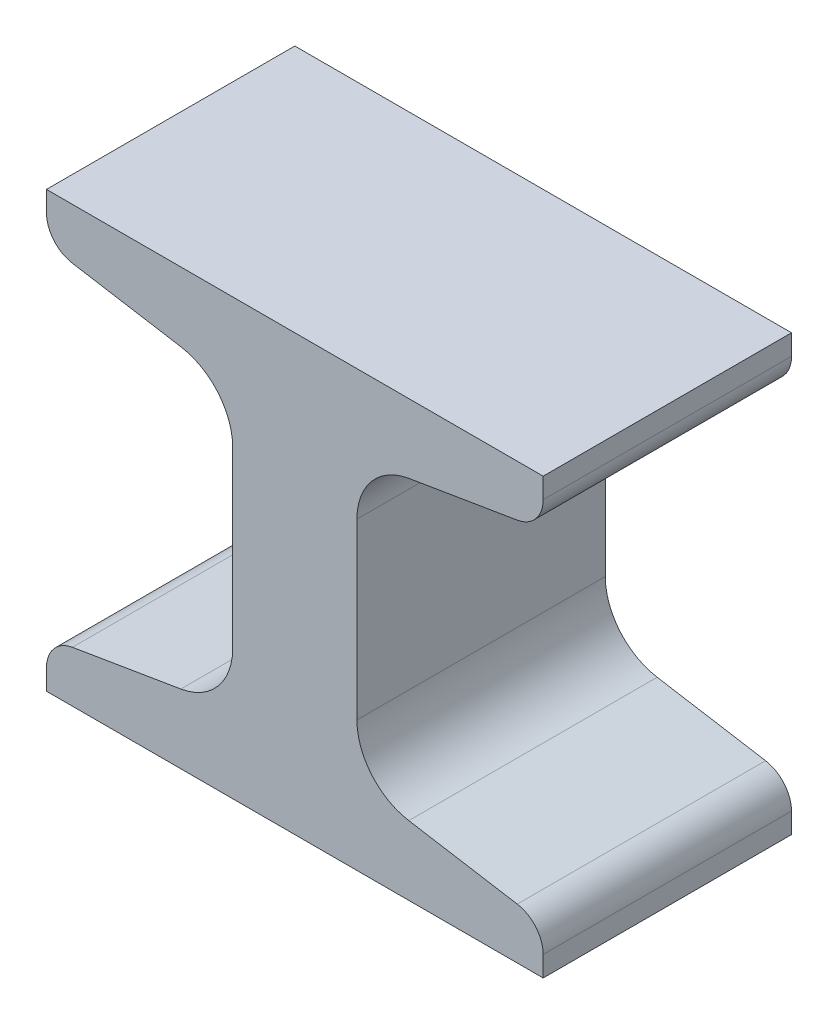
ISO-10303-21;
HEADER;
FILE_DESCRIPTION(('STEP AP214'),'2;1');
FILE_NAME('part.step','',(''),(''),'','','');
FILE_SCHEMA(('AUTOMOTIVE_DESIGN { 1 0 10303 214 1 1 1 1 }'));
ENDSEC;
DATA;
#1=APPLICATION_CONTEXT('core data for automotive mechanical design processes');
#2=APPLICATION_PROTOCOL_DEFINITION('international standard','automotive_design',2000,#1);
#3=PRODUCT_CONTEXT('',#1,'mechanical');
#4=PRODUCT('Part','Part','',(#3));
#5=PRODUCT_RELATED_PRODUCT_CATEGORY('part','',(#4));
#6=PRODUCT_DEFINITION_FORMATION('','',#4);
#7=PRODUCT_DEFINITION_CONTEXT('part definition',#1,'design');
#8=PRODUCT_DEFINITION('design','',#6,#7);
#9=PRODUCT_DEFINITION_SHAPE('','',#8);
#10=(LENGTH_UNIT() NAMED_UNIT(*) SI_UNIT(.MILLI.,.METRE.));
#11=(NAMED_UNIT(*) PLANE_ANGLE_UNIT() SI_UNIT($,.RADIAN.));
#12=(NAMED_UNIT(*) SI_UNIT($,.STERADIAN.) SOLID_ANGLE_UNIT());
#13=UNCERTAINTY_MEASURE_WITH_UNIT(LENGTH_MEASURE(1.E-05),#10,'distance_accuracy_value','');
#14=(GEOMETRIC_REPRESENTATION_CONTEXT(3) GLOBAL_UNCERTAINTY_ASSIGNED_CONTEXT((#13)) GLOBAL_UNIT_ASSIGNED_CONTEXT((#10,
#11,#12)) REPRESENTATION_CONTEXT('',''));
#15=CARTESIAN_POINT('',(0.,0.,0.));
#16=DIRECTION('',(0.,0.,1.));
#17=DIRECTION('',(1.,0.,0.));
#18=AXIS2_PLACEMENT_3D('',#15,#16,#17);
#19=CARTESIAN_POINT('',(50.8,-4.57140674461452E-13,12.7));
#20=DIRECTION('',(0.,-1.,0.));
#21=DIRECTION('',(1.,0.,0.));
#22=AXIS2_PLACEMENT_3D('',#19,#20,#21);
#23=PLANE('',#22);
#24=DIRECTION('',(-1.,0.,0.));
#25=VECTOR('',#24,1.);
#26=CARTESIAN_POINT('',(50.8,-4.57140674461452E-13,-12.7));
#27=LINE('',#26,#25);
#28=CARTESIAN_POINT('',(50.8,-4.57140674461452E-13,-12.7));
#29=VERTEX_POINT('',#28);
#30=CARTESIAN_POINT('',(0.,0.,-12.7));
#31=VERTEX_POINT('',#30);
#32=EDGE_CURVE('E234',#29,#31,#27,.T.);
#33=ORIENTED_EDGE('',*,*,#32,.F.);
#34=DIRECTION('',(0.,0.,-1.));
#35=VECTOR('',#34,1.);
#36=CARTESIAN_POINT('',(50.8,-4.57140674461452E-13,12.7));
#37=LINE('',#36,#35);
#38=CARTESIAN_POINT('',(50.8,-4.57140674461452E-13,12.7));
#39=VERTEX_POINT('',#38);
#40=EDGE_CURVE('E192',#39,#29,#37,.T.);
#41=ORIENTED_EDGE('',*,*,#40,.F.);
#42=DIRECTION('',(-1.,0.,0.));
#43=VECTOR('',#42,1.);
#44=CARTESIAN_POINT('',(50.8,-4.57140674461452E-13,12.7));
#45=LINE('',#44,#43);
#46=CARTESIAN_POINT('',(0.,0.,12.7));
#47=VERTEX_POINT('',#46);
#48=EDGE_CURVE('E187',#39,#47,#45,.T.);
#49=ORIENTED_EDGE('',*,*,#48,.T.);
#50=DIRECTION('',(0.,0.,-1.));
#51=VECTOR('',#50,1.);
#52=CARTESIAN_POINT('',(0.,0.,12.7));
#53=LINE('',#52,#51);
#54=EDGE_CURVE('E170',#47,#31,#53,.T.);
#55=ORIENTED_EDGE('',*,*,#54,.T.);
#56=EDGE_LOOP('',(#33,#41,#49,#55));
#57=FACE_BOUND('',#56,.T.);
#58=ADVANCED_FACE('F33',(#57),#23,.T.);
#59=CARTESIAN_POINT('',(50.8,4.77673693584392,12.7));
#60=DIRECTION('',(1.,0.,0.));
#61=DIRECTION('',(0.,0.,-1.));
#62=AXIS2_PLACEMENT_3D('',#59,#60,#61);
#63=PLANE('',#62);
#64=DIRECTION('',(0.,-1.,0.));
#65=VECTOR('',#64,1.);
#66=CARTESIAN_POINT('',(50.8,4.77673693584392,-12.7));
#67=LINE('',#66,#65);
#68=CARTESIAN_POINT('',(50.8,2.0871406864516,-12.7));
#69=VERTEX_POINT('',#68);
#70=EDGE_CURVE('E193',#69,#29,#67,.T.);
#71=ORIENTED_EDGE('',*,*,#70,.F.);
#72=DIRECTION('',(0.,0.,-1.));
#73=VECTOR('',#72,1.);
#74=CARTESIAN_POINT('',(50.8,2.0871406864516,12.7));
#75=LINE('',#74,#73);
#76=CARTESIAN_POINT('',(50.8,2.0871406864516,12.7));
#77=VERTEX_POINT('',#76);
#78=EDGE_CURVE('E306',#69,#77,#75,.F.);
#79=ORIENTED_EDGE('',*,*,#78,.T.);
#80=DIRECTION('',(0.,-1.,0.));
#81=VECTOR('',#80,1.);
#82=CARTESIAN_POINT('',(50.8,4.77673693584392,12.7));
#83=LINE('',#82,#81);
#84=EDGE_CURVE('E182',#77,#39,#83,.T.);
#85=ORIENTED_EDGE('',*,*,#84,.T.);
#86=ORIENTED_EDGE('',*,*,#40,.T.);
#87=EDGE_LOOP('',(#71,#79,#85,#86));
#88=FACE_BOUND('',#87,.T.);
#89=ADVANCED_FACE('F383',(#88),#63,.T.);
#90=CARTESIAN_POINT('',(37.0559923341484,7.06757198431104,12.7));
#91=DIRECTION('',(0.164410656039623,0.986391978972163,0.));
#92=DIRECTION('',(-0.986391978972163,0.164410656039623,0.));
#93=AXIS2_PLACEMENT_3D('',#90,#91,#92);
#94=PLANE('',#93);
#95=DIRECTION('',(0.986391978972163,-0.164410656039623,0.));
#96=VECTOR('',#95,1.);
#97=CARTESIAN_POINT('',(37.0559923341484,7.06757198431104,12.7));
#98=LINE('',#97,#96);
#99=CARTESIAN_POINT('',(37.0559923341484,7.06757198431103,12.7));
#100=VERTEX_POINT('',#99);
#101=CARTESIAN_POINT('',(48.1470038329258,5.21893521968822,12.7));
#102=VERTEX_POINT('',#101);
#103=EDGE_CURVE('E230',#100,#102,#98,.T.);
#104=ORIENTED_EDGE('',*,*,#103,.T.);
#105=DIRECTION('',(0.,0.,-1.));
#106=VECTOR('',#105,1.);
#107=CARTESIAN_POINT('',(48.1470038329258,5.21893521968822,12.7));
#108=LINE('',#107,#106);
#109=CARTESIAN_POINT('',(48.1470038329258,5.21893521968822,-12.7));
#110=VERTEX_POINT('',#109);
#111=EDGE_CURVE('E273',#102,#110,#108,.T.);
#112=ORIENTED_EDGE('',*,*,#111,.T.);
#113=DIRECTION('',(0.986391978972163,-0.164410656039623,0.));
#114=VECTOR('',#113,1.);
#115=CARTESIAN_POINT('',(37.0559923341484,7.06757198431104,-12.7));
#116=LINE('',#115,#114);
#117=CARTESIAN_POINT('',(37.0559923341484,7.06757198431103,-12.7));
#118=VERTEX_POINT('',#117);
#119=EDGE_CURVE('E195',#118,#110,#116,.T.);
#120=ORIENTED_EDGE('',*,*,#119,.F.);
#121=DIRECTION('',(0.,0.,-1.));
#122=VECTOR('',#121,1.);
#123=CARTESIAN_POINT('',(37.0559923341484,7.06757198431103,12.7));
#124=LINE('',#123,#122);
#125=EDGE_CURVE('E274',#100,#118,#124,.T.);
#126=ORIENTED_EDGE('',*,*,#125,.F.);
#127=EDGE_LOOP('',(#104,#112,#120,#126));
#128=FACE_BOUND('',#127,.T.);
#129=ADVANCED_FACE('F377',(#128),#94,.T.);
#130=CARTESIAN_POINT('',(38.1,13.3311610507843,12.7));
#131=DIRECTION('',(0.,0.,-1.));
#132=DIRECTION('',(-1.,0.,0.));
#133=AXIS2_PLACEMENT_3D('',#130,#131,#132);
#134=CYLINDRICAL_SURFACE('',#133,6.35);
#135=CARTESIAN_POINT('',(38.1,13.3311610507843,-12.7));
#136=DIRECTION('',(0.,0.,1.));
#137=DIRECTION('',(1.,0.,0.));
#138=AXIS2_PLACEMENT_3D('',#135,#136,#137);
#139=CIRCLE('',#138,6.35);
#140=CARTESIAN_POINT('',(31.75,13.3311610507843,-12.7));
#141=VERTEX_POINT('',#140);
#142=EDGE_CURVE('E267',#141,#118,#139,.T.);
#143=ORIENTED_EDGE('',*,*,#142,.F.);
#144=DIRECTION('',(0.,0.,-1.));
#145=VECTOR('',#144,1.);
#146=CARTESIAN_POINT('',(31.75,13.3311610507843,12.7));
#147=LINE('',#146,#145);
#148=CARTESIAN_POINT('',(31.75,13.3311610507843,12.7));
#149=VERTEX_POINT('',#148);
#150=EDGE_CURVE('E276',#149,#141,#147,.T.);
#151=ORIENTED_EDGE('',*,*,#150,.F.);
#152=CARTESIAN_POINT('',(38.1,13.3311610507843,12.7));
#153=DIRECTION('',(0.,0.,1.));
#154=DIRECTION('',(1.,0.,0.));
#155=AXIS2_PLACEMENT_3D('',#152,#153,#154);
#156=CIRCLE('',#155,6.35);
#157=EDGE_CURVE('E227',#149,#100,#156,.T.);
#158=ORIENTED_EDGE('',*,*,#157,.T.);
#159=ORIENTED_EDGE('',*,*,#125,.T.);
#160=EDGE_LOOP('',(#143,#151,#158,#159));
#161=FACE_BOUND('',#160,.T.);
#162=ADVANCED_FACE('F373',(#161),#134,.F.);
#163=CARTESIAN_POINT('',(31.75,31.1188389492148,12.7));
#164=DIRECTION('',(1.,0.,0.));
#165=DIRECTION('',(0.,1.,0.));
#166=AXIS2_PLACEMENT_3D('',#163,#164,#165);
#167=PLANE('',#166);
#168=DIRECTION('',(0.,-1.,0.));
#169=VECTOR('',#168,1.);
#170=CARTESIAN_POINT('',(31.75,31.1188389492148,-12.7));
#171=LINE('',#170,#169);
#172=CARTESIAN_POINT('',(31.75,31.1188389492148,-12.7));
#173=VERTEX_POINT('',#172);
#174=EDGE_CURVE('E264',#173,#141,#171,.T.);
#175=ORIENTED_EDGE('',*,*,#174,.F.);
#176=DIRECTION('',(0.,0.,-1.));
#177=VECTOR('',#176,1.);
#178=CARTESIAN_POINT('',(31.75,31.1188389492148,12.7));
#179=LINE('',#178,#177);
#180=CARTESIAN_POINT('',(31.75,31.1188389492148,12.7));
#181=VERTEX_POINT('',#180);
#182=EDGE_CURVE('E278',#181,#173,#179,.T.);
#183=ORIENTED_EDGE('',*,*,#182,.F.);
#184=DIRECTION('',(0.,-1.,0.));
#185=VECTOR('',#184,1.);
#186=CARTESIAN_POINT('',(31.75,31.1188389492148,12.7));
#187=LINE('',#186,#185);
#188=EDGE_CURVE('E224',#181,#149,#187,.T.);
#189=ORIENTED_EDGE('',*,*,#188,.T.);
#190=ORIENTED_EDGE('',*,*,#150,.T.);
#191=EDGE_LOOP('',(#175,#183,#189,#190));
#192=FACE_BOUND('',#191,.T.);
#193=ADVANCED_FACE('F369',(#192),#167,.T.);
#194=CARTESIAN_POINT('',(38.1,31.1188389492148,12.7));
#195=DIRECTION('',(0.,0.,-1.));
#196=DIRECTION('',(-1.,0.,0.));
#197=AXIS2_PLACEMENT_3D('',#194,#195,#196);
#198=CYLINDRICAL_SURFACE('',#197,6.35);
#199=CARTESIAN_POINT('',(38.1,31.1188389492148,-12.7));
#200=DIRECTION('',(0.,0.,1.));
#201=DIRECTION('',(1.,0.,0.));
#202=AXIS2_PLACEMENT_3D('',#199,#200,#201);
#203=CIRCLE('',#202,6.35);
#204=CARTESIAN_POINT('',(37.0559923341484,37.382428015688,-12.7));
#205=VERTEX_POINT('',#204);
#206=EDGE_CURVE('E261',#205,#173,#203,.T.);
#207=ORIENTED_EDGE('',*,*,#206,.F.);
#208=DIRECTION('',(0.,0.,-1.));
#209=VECTOR('',#208,1.);
#210=CARTESIAN_POINT('',(37.0559923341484,37.382428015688,12.7));
#211=LINE('',#210,#209);
#212=CARTESIAN_POINT('',(37.0559923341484,37.382428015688,12.7));
#213=VERTEX_POINT('',#212);
#214=EDGE_CURVE('E280',#213,#205,#211,.T.);
#215=ORIENTED_EDGE('',*,*,#214,.F.);
#216=CARTESIAN_POINT('',(38.1,31.1188389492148,12.7));
#217=DIRECTION('',(0.,0.,1.));
#218=DIRECTION('',(1.,0.,0.));
#219=AXIS2_PLACEMENT_3D('',#216,#217,#218);
#220=CIRCLE('',#219,6.35);
#221=EDGE_CURVE('E221',#213,#181,#220,.T.);
#222=ORIENTED_EDGE('',*,*,#221,.T.);
#223=ORIENTED_EDGE('',*,*,#182,.T.);
#224=EDGE_LOOP('',(#207,#215,#222,#223));
#225=FACE_BOUND('',#224,.T.);
#226=ADVANCED_FACE('F365',(#225),#198,.F.);
#227=CARTESIAN_POINT('',(50.8,39.6732630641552,12.7));
#228=DIRECTION('',(0.164410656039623,-0.986391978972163,0.));
#229=DIRECTION('',(0.986391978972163,0.164410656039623,0.));
#230=AXIS2_PLACEMENT_3D('',#227,#228,#229);
#231=PLANE('',#230);
#232=DIRECTION('',(-0.986391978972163,-0.164410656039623,0.));
#233=VECTOR('',#232,1.);
#234=CARTESIAN_POINT('',(50.8,39.6732630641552,-12.7));
#235=LINE('',#234,#233);
#236=CARTESIAN_POINT('',(48.1470038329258,39.2310647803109,-12.7));
#237=VERTEX_POINT('',#236);
#238=EDGE_CURVE('E259',#237,#205,#235,.T.);
#239=ORIENTED_EDGE('',*,*,#238,.F.);
#240=DIRECTION('',(0.,0.,-1.));
#241=VECTOR('',#240,1.);
#242=CARTESIAN_POINT('',(48.1470038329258,39.2310647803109,12.7));
#243=LINE('',#242,#241);
#244=CARTESIAN_POINT('',(48.1470038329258,39.2310647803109,12.7));
#245=VERTEX_POINT('',#244);
#246=EDGE_CURVE('E321',#237,#245,#243,.F.);
#247=ORIENTED_EDGE('',*,*,#246,.T.);
#248=DIRECTION('',(-0.986391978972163,-0.164410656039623,0.));
#249=VECTOR('',#248,1.);
#250=CARTESIAN_POINT('',(50.8,39.6732630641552,12.7));
#251=LINE('',#250,#249);
#252=EDGE_CURVE('E219',#245,#213,#251,.T.);
#253=ORIENTED_EDGE('',*,*,#252,.T.);
#254=ORIENTED_EDGE('',*,*,#214,.T.);
#255=EDGE_LOOP('',(#239,#247,#253,#254));
#256=FACE_BOUND('',#255,.T.);
#257=ADVANCED_FACE('F359',(#256),#231,.T.);
#258=CARTESIAN_POINT('',(50.8,44.4499999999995,12.7));
#259=DIRECTION('',(1.,0.,0.));
#260=DIRECTION('',(0.,1.,0.));
#261=AXIS2_PLACEMENT_3D('',#258,#259,#260);
#262=PLANE('',#261);
#263=DIRECTION('',(0.,-1.,0.));
#264=VECTOR('',#263,1.);
#265=CARTESIAN_POINT('',(50.8,44.4499999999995,12.7));
#266=LINE('',#265,#264);
#267=CARTESIAN_POINT('',(50.8,44.4499999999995,12.7));
#268=VERTEX_POINT('',#267);
#269=CARTESIAN_POINT('',(50.8,42.3628593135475,12.7));
#270=VERTEX_POINT('',#269);
#271=EDGE_CURVE('E216',#268,#270,#266,.T.);
#272=ORIENTED_EDGE('',*,*,#271,.T.);
#273=DIRECTION('',(0.,0.,-1.));
#274=VECTOR('',#273,1.);
#275=CARTESIAN_POINT('',(50.8,42.3628593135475,12.7));
#276=LINE('',#275,#274);
#277=CARTESIAN_POINT('',(50.8,42.3628593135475,-12.7));
#278=VERTEX_POINT('',#277);
#279=EDGE_CURVE('E318',#270,#278,#276,.T.);
#280=ORIENTED_EDGE('',*,*,#279,.T.);
#281=DIRECTION('',(0.,-1.,0.));
#282=VECTOR('',#281,1.);
#283=CARTESIAN_POINT('',(50.8,44.4499999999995,-12.7));
#284=LINE('',#283,#282);
#285=CARTESIAN_POINT('',(50.8,44.4499999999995,-12.7));
#286=VERTEX_POINT('',#285);
#287=EDGE_CURVE('E256',#286,#278,#284,.T.);
#288=ORIENTED_EDGE('',*,*,#287,.F.);
#289=DIRECTION('',(0.,0.,-1.));
#290=VECTOR('',#289,1.);
#291=CARTESIAN_POINT('',(50.8,44.4499999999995,12.7));
#292=LINE('',#291,#290);
#293=EDGE_CURVE('E283',#268,#286,#292,.T.);
#294=ORIENTED_EDGE('',*,*,#293,.F.);
#295=EDGE_LOOP('',(#272,#280,#288,#294));
#296=FACE_BOUND('',#295,.T.);
#297=ADVANCED_FACE('F351',(#296),#262,.T.);
#298=CARTESIAN_POINT('',(0.,44.4499999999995,12.7));
#299=DIRECTION('',(0.,1.,0.));
#300=DIRECTION('',(0.,0.,1.));
#301=AXIS2_PLACEMENT_3D('',#298,#299,#300);
#302=PLANE('',#301);
#303=DIRECTION('',(1.,0.,0.));
#304=VECTOR('',#303,1.);
#305=CARTESIAN_POINT('',(0.,44.4499999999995,-12.7));
#306=LINE('',#305,#304);
#307=CARTESIAN_POINT('',(0.,44.4499999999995,-12.7));
#308=VERTEX_POINT('',#307);
#309=EDGE_CURVE('E253',#308,#286,#306,.T.);
#310=ORIENTED_EDGE('',*,*,#309,.F.);
#311=DIRECTION('',(0.,0.,-1.));
#312=VECTOR('',#311,1.);
#313=CARTESIAN_POINT('',(0.,44.4499999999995,12.7));
#314=LINE('',#313,#312);
#315=CARTESIAN_POINT('',(0.,44.4499999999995,12.7));
#316=VERTEX_POINT('',#315);
#317=EDGE_CURVE('E285',#316,#308,#314,.T.);
#318=ORIENTED_EDGE('',*,*,#317,.F.);
#319=DIRECTION('',(1.,0.,0.));
#320=VECTOR('',#319,1.);
#321=CARTESIAN_POINT('',(0.,44.4499999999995,12.7));
#322=LINE('',#321,#320);
#323=EDGE_CURVE('E213',#316,#268,#322,.T.);
#324=ORIENTED_EDGE('',*,*,#323,.T.);
#325=ORIENTED_EDGE('',*,*,#293,.T.);
#326=EDGE_LOOP('',(#310,#318,#324,#325));
#327=FACE_BOUND('',#326,.T.);
#328=ADVANCED_FACE('F348',(#327),#302,.T.);
#329=CARTESIAN_POINT('',(0.,39.6732630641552,12.7));
#330=DIRECTION('',(-1.,0.,0.));
#331=DIRECTION('',(0.,-1.,0.));
#332=AXIS2_PLACEMENT_3D('',#329,#330,#331);
#333=PLANE('',#332);
#334=DIRECTION('',(0.,1.,0.));
#335=VECTOR('',#334,1.);
#336=CARTESIAN_POINT('',(0.,39.6732630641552,-12.7));
#337=LINE('',#336,#335);
#338=CARTESIAN_POINT('',(0.,42.3628593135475,-12.7));
#339=VERTEX_POINT('',#338);
#340=EDGE_CURVE('E251',#339,#308,#337,.T.);
#341=ORIENTED_EDGE('',*,*,#340,.F.);
#342=DIRECTION('',(0.,0.,-1.));
#343=VECTOR('',#342,1.);
#344=CARTESIAN_POINT('',(0.,42.3628593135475,12.7));
#345=LINE('',#344,#343);
#346=CARTESIAN_POINT('',(0.,42.3628593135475,12.7));
#347=VERTEX_POINT('',#346);
#348=EDGE_CURVE('E11',#339,#347,#345,.F.);
#349=ORIENTED_EDGE('',*,*,#348,.T.);
#350=DIRECTION('',(0.,1.,0.));
#351=VECTOR('',#350,1.);
#352=CARTESIAN_POINT('',(0.,39.6732630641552,12.7));
#353=LINE('',#352,#351);
#354=EDGE_CURVE('E211',#347,#316,#353,.T.);
#355=ORIENTED_EDGE('',*,*,#354,.T.);
#356=ORIENTED_EDGE('',*,*,#317,.T.);
#357=EDGE_LOOP('',(#341,#349,#355,#356));
#358=FACE_BOUND('',#357,.T.);
#359=ADVANCED_FACE('F343',(#358),#333,.T.);
#360=CARTESIAN_POINT('',(13.7440076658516,37.382428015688,12.7));
#361=DIRECTION('',(-0.164410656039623,-0.986391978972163,0.));
#362=DIRECTION('',(0.986391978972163,-0.164410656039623,0.));
#363=AXIS2_PLACEMENT_3D('',#360,#361,#362);
#364=PLANE('',#363);
#365=DIRECTION('',(-0.986391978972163,0.164410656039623,0.));
#366=VECTOR('',#365,1.);
#367=CARTESIAN_POINT('',(13.7440076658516,37.382428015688,12.7));
#368=LINE('',#367,#366);
#369=CARTESIAN_POINT('',(13.7440076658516,37.382428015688,12.7));
#370=VERTEX_POINT('',#369);
#371=CARTESIAN_POINT('',(2.65299616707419,39.2310647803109,12.7));
#372=VERTEX_POINT('',#371);
#373=EDGE_CURVE('E208',#370,#372,#368,.T.);
#374=ORIENTED_EDGE('',*,*,#373,.T.);
#375=DIRECTION('',(0.,0.,-1.));
#376=VECTOR('',#375,1.);
#377=CARTESIAN_POINT('',(2.65299616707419,39.2310647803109,12.7));
#378=LINE('',#377,#376);
#379=CARTESIAN_POINT('',(2.65299616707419,39.2310647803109,-12.7));
#380=VERTEX_POINT('',#379);
#381=EDGE_CURVE('E41',#372,#380,#378,.T.);
#382=ORIENTED_EDGE('',*,*,#381,.T.);
#383=DIRECTION('',(-0.986391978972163,0.164410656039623,0.));
#384=VECTOR('',#383,1.);
#385=CARTESIAN_POINT('',(13.7440076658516,37.382428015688,-12.7));
#386=LINE('',#385,#384);
#387=CARTESIAN_POINT('',(13.7440076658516,37.382428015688,-12.7));
#388=VERTEX_POINT('',#387);
#389=EDGE_CURVE('E248',#388,#380,#386,.T.);
#390=ORIENTED_EDGE('',*,*,#389,.F.);
#391=DIRECTION('',(0.,0.,-1.));
#392=VECTOR('',#391,1.);
#393=CARTESIAN_POINT('',(13.7440076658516,37.382428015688,12.7));
#394=LINE('',#393,#392);
#395=EDGE_CURVE('E288',#370,#388,#394,.T.);
#396=ORIENTED_EDGE('',*,*,#395,.F.);
#397=EDGE_LOOP('',(#374,#382,#390,#396));
#398=FACE_BOUND('',#397,.T.);
#399=ADVANCED_FACE('F326',(#398),#364,.T.);
#400=CARTESIAN_POINT('',(12.7,31.1188389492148,12.7));
#401=DIRECTION('',(0.,0.,-1.));
#402=DIRECTION('',(-1.,0.,0.));
#403=AXIS2_PLACEMENT_3D('',#400,#401,#402);
#404=CYLINDRICAL_SURFACE('',#403,6.34999999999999);
#405=CARTESIAN_POINT('',(12.7,31.1188389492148,-12.7));
#406=DIRECTION('',(0.,0.,1.));
#407=DIRECTION('',(1.,0.,0.));
#408=AXIS2_PLACEMENT_3D('',#405,#406,#407);
#409=CIRCLE('',#408,6.34999999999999);
#410=CARTESIAN_POINT('',(19.05,31.1188389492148,-12.7));
#411=VERTEX_POINT('',#410);
#412=EDGE_CURVE('E245',#411,#388,#409,.T.);
#413=ORIENTED_EDGE('',*,*,#412,.F.);
#414=DIRECTION('',(0.,0.,-1.));
#415=VECTOR('',#414,1.);
#416=CARTESIAN_POINT('',(19.05,31.1188389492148,12.7));
#417=LINE('',#416,#415);
#418=CARTESIAN_POINT('',(19.05,31.1188389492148,12.7));
#419=VERTEX_POINT('',#418);
#420=EDGE_CURVE('E290',#419,#411,#417,.T.);
#421=ORIENTED_EDGE('',*,*,#420,.F.);
#422=CARTESIAN_POINT('',(12.7,31.1188389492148,12.7));
#423=DIRECTION('',(0.,0.,1.));
#424=DIRECTION('',(1.,0.,0.));
#425=AXIS2_PLACEMENT_3D('',#422,#423,#424);
#426=CIRCLE('',#425,6.34999999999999);
#427=EDGE_CURVE('E205',#419,#370,#426,.T.);
#428=ORIENTED_EDGE('',*,*,#427,.T.);
#429=ORIENTED_EDGE('',*,*,#395,.T.);
#430=EDGE_LOOP('',(#413,#421,#428,#429));
#431=FACE_BOUND('',#430,.T.);
#432=ADVANCED_FACE('F336',(#431),#404,.F.);
#433=CARTESIAN_POINT('',(19.05,13.3311610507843,12.7));
#434=DIRECTION('',(-1.,0.,0.));
#435=DIRECTION('',(0.,-1.,0.));
#436=AXIS2_PLACEMENT_3D('',#433,#434,#435);
#437=PLANE('',#436);
#438=DIRECTION('',(0.,1.,0.));
#439=VECTOR('',#438,1.);
#440=CARTESIAN_POINT('',(19.05,13.3311610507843,-12.7));
#441=LINE('',#440,#439);
#442=CARTESIAN_POINT('',(19.05,13.3311610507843,-12.7));
#443=VERTEX_POINT('',#442);
#444=EDGE_CURVE('E242',#443,#411,#441,.T.);
#445=ORIENTED_EDGE('',*,*,#444,.F.);
#446=DIRECTION('',(0.,0.,-1.));
#447=VECTOR('',#446,1.);
#448=CARTESIAN_POINT('',(19.05,13.3311610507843,12.7));
#449=LINE('',#448,#447);
#450=CARTESIAN_POINT('',(19.05,13.3311610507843,12.7));
#451=VERTEX_POINT('',#450);
#452=EDGE_CURVE('E292',#451,#443,#449,.T.);
#453=ORIENTED_EDGE('',*,*,#452,.F.);
#454=DIRECTION('',(0.,1.,0.));
#455=VECTOR('',#454,1.);
#456=CARTESIAN_POINT('',(19.05,13.3311610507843,12.7));
#457=LINE('',#456,#455);
#458=EDGE_CURVE('E202',#451,#419,#457,.T.);
#459=ORIENTED_EDGE('',*,*,#458,.T.);
#460=ORIENTED_EDGE('',*,*,#420,.T.);
#461=EDGE_LOOP('',(#445,#453,#459,#460));
#462=FACE_BOUND('',#461,.T.);
#463=ADVANCED_FACE('F411',(#462),#437,.T.);
#464=CARTESIAN_POINT('',(12.7,13.3311610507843,12.7));
#465=DIRECTION('',(0.,0.,-1.));
#466=DIRECTION('',(-1.,0.,0.));
#467=AXIS2_PLACEMENT_3D('',#464,#465,#466);
#468=CYLINDRICAL_SURFACE('',#467,6.35);
#469=CARTESIAN_POINT('',(12.7,13.3311610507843,-12.7));
#470=DIRECTION('',(0.,0.,1.));
#471=DIRECTION('',(1.,0.,0.));
#472=AXIS2_PLACEMENT_3D('',#469,#470,#471);
#473=CIRCLE('',#472,6.35);
#474=CARTESIAN_POINT('',(13.7440076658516,7.06757198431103,-12.7));
#475=VERTEX_POINT('',#474);
#476=EDGE_CURVE('E239',#475,#443,#473,.T.);
#477=ORIENTED_EDGE('',*,*,#476,.F.);
#478=DIRECTION('',(0.,0.,-1.));
#479=VECTOR('',#478,1.);
#480=CARTESIAN_POINT('',(13.7440076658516,7.06757198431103,12.7));
#481=LINE('',#480,#479);
#482=CARTESIAN_POINT('',(13.7440076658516,7.06757198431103,12.7));
#483=VERTEX_POINT('',#482);
#484=EDGE_CURVE('E181',#483,#475,#481,.T.);
#485=ORIENTED_EDGE('',*,*,#484,.F.);
#486=CARTESIAN_POINT('',(12.7,13.3311610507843,12.7));
#487=DIRECTION('',(0.,0.,1.));
#488=DIRECTION('',(1.,0.,0.));
#489=AXIS2_PLACEMENT_3D('',#486,#487,#488);
#490=CIRCLE('',#489,6.35);
#491=EDGE_CURVE('E199',#483,#451,#490,.T.);
#492=ORIENTED_EDGE('',*,*,#491,.T.);
#493=ORIENTED_EDGE('',*,*,#452,.T.);
#494=EDGE_LOOP('',(#477,#485,#492,#493));
#495=FACE_BOUND('',#494,.T.);
#496=ADVANCED_FACE('F408',(#495),#468,.F.);
#497=CARTESIAN_POINT('',(0.,4.77673693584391,12.7));
#498=DIRECTION('',(-0.164410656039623,0.986391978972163,0.));
#499=DIRECTION('',(-0.986391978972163,-0.164410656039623,0.));
#500=AXIS2_PLACEMENT_3D('',#497,#498,#499);
#501=PLANE('',#500);
#502=DIRECTION('',(0.986391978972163,0.164410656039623,0.));
#503=VECTOR('',#502,1.);
#504=CARTESIAN_POINT('',(0.,4.77673693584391,-12.7));
#505=LINE('',#504,#503);
#506=CARTESIAN_POINT('',(2.6529961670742,5.21893521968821,-12.7));
#507=VERTEX_POINT('',#506);
#508=EDGE_CURVE('E237',#507,#475,#505,.T.);
#509=ORIENTED_EDGE('',*,*,#508,.F.);
#510=DIRECTION('',(0.,0.,-1.));
#511=VECTOR('',#510,1.);
#512=CARTESIAN_POINT('',(2.6529961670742,5.21893521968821,12.7));
#513=LINE('',#512,#511);
#514=CARTESIAN_POINT('',(2.6529961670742,5.21893521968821,12.7));
#515=VERTEX_POINT('',#514);
#516=EDGE_CURVE('E56',#507,#515,#513,.F.);
#517=ORIENTED_EDGE('',*,*,#516,.T.);
#518=DIRECTION('',(0.986391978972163,0.164410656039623,0.));
#519=VECTOR('',#518,1.);
#520=CARTESIAN_POINT('',(0.,4.77673693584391,12.7));
#521=LINE('',#520,#519);
#522=EDGE_CURVE('E188',#515,#483,#521,.T.);
#523=ORIENTED_EDGE('',*,*,#522,.T.);
#524=ORIENTED_EDGE('',*,*,#484,.T.);
#525=EDGE_LOOP('',(#509,#517,#523,#524));
#526=FACE_BOUND('',#525,.T.);
#527=ADVANCED_FACE('F405',(#526),#501,.T.);
#528=CARTESIAN_POINT('',(0.,0.,12.7));
#529=DIRECTION('',(-1.,0.,0.));
#530=DIRECTION('',(0.,-1.,0.));
#531=AXIS2_PLACEMENT_3D('',#528,#529,#530);
#532=PLANE('',#531);
#533=DIRECTION('',(0.,1.,0.));
#534=VECTOR('',#533,1.);
#535=CARTESIAN_POINT('',(0.,0.,12.7));
#536=LINE('',#535,#534);
#537=CARTESIAN_POINT('',(0.,2.0871406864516,12.7));
#538=VERTEX_POINT('',#537);
#539=EDGE_CURVE('E173',#47,#538,#536,.T.);
#540=ORIENTED_EDGE('',*,*,#539,.T.);
#541=DIRECTION('',(0.,0.,-1.));
#542=VECTOR('',#541,1.);
#543=CARTESIAN_POINT('',(0.,2.0871406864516,12.7));
#544=LINE('',#543,#542);
#545=CARTESIAN_POINT('',(0.,2.0871406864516,-12.7));
#546=VERTEX_POINT('',#545);
#547=EDGE_CURVE('E315',#538,#546,#544,.T.);
#548=ORIENTED_EDGE('',*,*,#547,.T.);
#549=DIRECTION('',(0.,1.,0.));
#550=VECTOR('',#549,1.);
#551=CARTESIAN_POINT('',(0.,0.,-12.7));
#552=LINE('',#551,#550);
#553=EDGE_CURVE('E176',#31,#546,#552,.T.);
#554=ORIENTED_EDGE('',*,*,#553,.F.);
#555=ORIENTED_EDGE('',*,*,#54,.F.);
#556=EDGE_LOOP('',(#540,#548,#554,#555));
#557=FACE_BOUND('',#556,.T.);
#558=ADVANCED_FACE('F171',(#557),#532,.T.);
#559=CARTESIAN_POINT('',(12.7,13.3311610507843,12.7));
#560=DIRECTION('',(0.,0.,1.));
#561=DIRECTION('',(1.,0.,0.));
#562=AXIS2_PLACEMENT_3D('',#559,#560,#561);
#563=PLANE('',#562);
#564=ORIENTED_EDGE('',*,*,#84,.F.);
#565=CARTESIAN_POINT('',(47.625,2.0871406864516,12.7));
#566=DIRECTION('',(0.,0.,1.));
#567=DIRECTION('',(1.,0.,0.));
#568=AXIS2_PLACEMENT_3D('',#565,#566,#567);
#569=CIRCLE('',#568,3.175);
#570=EDGE_CURVE('E313',#77,#102,#569,.T.);
#571=ORIENTED_EDGE('',*,*,#570,.T.);
#572=ORIENTED_EDGE('',*,*,#103,.F.);
#573=ORIENTED_EDGE('',*,*,#157,.F.);
#574=ORIENTED_EDGE('',*,*,#188,.F.);
#575=ORIENTED_EDGE('',*,*,#221,.F.);
#576=ORIENTED_EDGE('',*,*,#252,.F.);
#577=CARTESIAN_POINT('',(47.625,42.3628593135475,12.7));
#578=DIRECTION('',(0.,0.,1.));
#579=DIRECTION('',(1.,0.,0.));
#580=AXIS2_PLACEMENT_3D('',#577,#578,#579);
#581=CIRCLE('',#580,3.175);
#582=EDGE_CURVE('E310',#245,#270,#581,.T.);
#583=ORIENTED_EDGE('',*,*,#582,.T.);
#584=ORIENTED_EDGE('',*,*,#271,.F.);
#585=ORIENTED_EDGE('',*,*,#323,.F.);
#586=ORIENTED_EDGE('',*,*,#354,.F.);
#587=CARTESIAN_POINT('',(3.17499999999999,42.3628593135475,12.7));
#588=DIRECTION('',(0.,0.,1.));
#589=DIRECTION('',(1.,0.,0.));
#590=AXIS2_PLACEMENT_3D('',#587,#588,#589);
#591=CIRCLE('',#590,3.175);
#592=EDGE_CURVE('E308',#347,#372,#591,.T.);
#593=ORIENTED_EDGE('',*,*,#592,.T.);
#594=ORIENTED_EDGE('',*,*,#373,.F.);
#595=ORIENTED_EDGE('',*,*,#427,.F.);
#596=ORIENTED_EDGE('',*,*,#458,.F.);
#597=ORIENTED_EDGE('',*,*,#491,.F.);
#598=ORIENTED_EDGE('',*,*,#522,.F.);
#599=CARTESIAN_POINT('',(3.175,2.0871406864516,12.7));
#600=DIRECTION('',(0.,0.,1.));
#601=DIRECTION('',(1.,0.,0.));
#602=AXIS2_PLACEMENT_3D('',#599,#600,#601);
#603=CIRCLE('',#602,3.175);
#604=EDGE_CURVE('E48',#515,#538,#603,.T.);
#605=ORIENTED_EDGE('',*,*,#604,.T.);
#606=ORIENTED_EDGE('',*,*,#539,.F.);
#607=ORIENTED_EDGE('',*,*,#48,.F.);
#608=EDGE_LOOP('',(#564,#571,#572,#573,#574,#575,#576,#583,#584,#585,#586,#593,#594,#595,#596,
#597,#598,#605,#606,#607));
#609=FACE_BOUND('',#608,.T.);
#610=ADVANCED_FACE('F186',(#609),#563,.T.);
#611=CARTESIAN_POINT('',(12.7,13.3311610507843,-12.7));
#612=DIRECTION('',(0.,0.,1.));
#613=DIRECTION('',(1.,0.,0.));
#614=AXIS2_PLACEMENT_3D('',#611,#612,#613);
#615=PLANE('',#614);
#616=ORIENTED_EDGE('',*,*,#119,.T.);
#617=CARTESIAN_POINT('',(47.625,2.0871406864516,-12.7));
#618=DIRECTION('',(0.,0.,1.));
#619=DIRECTION('',(1.,0.,0.));
#620=AXIS2_PLACEMENT_3D('',#617,#618,#619);
#621=CIRCLE('',#620,3.175);
#622=EDGE_CURVE('E304',#110,#69,#621,.F.);
#623=ORIENTED_EDGE('',*,*,#622,.T.);
#624=ORIENTED_EDGE('',*,*,#70,.T.);
#625=ORIENTED_EDGE('',*,*,#32,.T.);
#626=ORIENTED_EDGE('',*,*,#553,.T.);
#627=CARTESIAN_POINT('',(3.175,2.0871406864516,-12.7));
#628=DIRECTION('',(0.,0.,1.));
#629=DIRECTION('',(1.,0.,0.));
#630=AXIS2_PLACEMENT_3D('',#627,#628,#629);
#631=CIRCLE('',#630,3.175);
#632=EDGE_CURVE('E302',#546,#507,#631,.F.);
#633=ORIENTED_EDGE('',*,*,#632,.T.);
#634=ORIENTED_EDGE('',*,*,#508,.T.);
#635=ORIENTED_EDGE('',*,*,#476,.T.);
#636=ORIENTED_EDGE('',*,*,#444,.T.);
#637=ORIENTED_EDGE('',*,*,#412,.T.);
#638=ORIENTED_EDGE('',*,*,#389,.T.);
#639=CARTESIAN_POINT('',(3.17499999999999,42.3628593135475,-12.7));
#640=DIRECTION('',(0.,0.,1.));
#641=DIRECTION('',(1.,0.,0.));
#642=AXIS2_PLACEMENT_3D('',#639,#640,#641);
#643=CIRCLE('',#642,3.175);
#644=EDGE_CURVE('E298',#380,#339,#643,.F.);
#645=ORIENTED_EDGE('',*,*,#644,.T.);
#646=ORIENTED_EDGE('',*,*,#340,.T.);
#647=ORIENTED_EDGE('',*,*,#309,.T.);
#648=ORIENTED_EDGE('',*,*,#287,.T.);
#649=CARTESIAN_POINT('',(47.625,42.3628593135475,-12.7));
#650=DIRECTION('',(0.,0.,1.));
#651=DIRECTION('',(1.,0.,0.));
#652=AXIS2_PLACEMENT_3D('',#649,#650,#651);
#653=CIRCLE('',#652,3.175);
#654=EDGE_CURVE('E300',#278,#237,#653,.F.);
#655=ORIENTED_EDGE('',*,*,#654,.T.);
#656=ORIENTED_EDGE('',*,*,#238,.T.);
#657=ORIENTED_EDGE('',*,*,#206,.T.);
#658=ORIENTED_EDGE('',*,*,#174,.T.);
#659=ORIENTED_EDGE('',*,*,#142,.T.);
#660=EDGE_LOOP('',(#616,#623,#624,#625,#626,#633,#634,#635,#636,#637,#638,#645,#646,#647,#648,
#655,#656,#657,#658,#659));
#661=FACE_BOUND('',#660,.T.);
#662=ADVANCED_FACE('F331',(#661),#615,.F.);
#663=CARTESIAN_POINT('',(47.625,2.0871406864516,12.7));
#664=DIRECTION('',(0.,0.,-1.));
#665=DIRECTION('',(-1.,0.,0.));
#666=AXIS2_PLACEMENT_3D('',#663,#664,#665);
#667=CYLINDRICAL_SURFACE('',#666,3.175);
#668=ORIENTED_EDGE('',*,*,#570,.F.);
#669=ORIENTED_EDGE('',*,*,#78,.F.);
#670=ORIENTED_EDGE('',*,*,#622,.F.);
#671=ORIENTED_EDGE('',*,*,#111,.F.);
#672=EDGE_LOOP('',(#668,#669,#670,#671));
#673=FACE_BOUND('',#672,.T.);
#674=ADVANCED_FACE('F385',(#673),#667,.T.);
#675=CARTESIAN_POINT('',(3.175,2.0871406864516,12.7));
#676=DIRECTION('',(0.,0.,-1.));
#677=DIRECTION('',(-1.,0.,0.));
#678=AXIS2_PLACEMENT_3D('',#675,#676,#677);
#679=CYLINDRICAL_SURFACE('',#678,3.175);
#680=ORIENTED_EDGE('',*,*,#604,.F.);
#681=ORIENTED_EDGE('',*,*,#516,.F.);
#682=ORIENTED_EDGE('',*,*,#632,.F.);
#683=ORIENTED_EDGE('',*,*,#547,.F.);
#684=EDGE_LOOP('',(#680,#681,#682,#683));
#685=FACE_BOUND('',#684,.T.);
#686=ADVANCED_FACE('F387',(#685),#679,.T.);
#687=CARTESIAN_POINT('',(47.625,42.3628593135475,12.7));
#688=DIRECTION('',(0.,0.,-1.));
#689=DIRECTION('',(-1.,0.,0.));
#690=AXIS2_PLACEMENT_3D('',#687,#688,#689);
#691=CYLINDRICAL_SURFACE('',#690,3.175);
#692=ORIENTED_EDGE('',*,*,#582,.F.);
#693=ORIENTED_EDGE('',*,*,#246,.F.);
#694=ORIENTED_EDGE('',*,*,#654,.F.);
#695=ORIENTED_EDGE('',*,*,#279,.F.);
#696=EDGE_LOOP('',(#692,#693,#694,#695));
#697=FACE_BOUND('',#696,.T.);
#698=ADVANCED_FACE('F355',(#697),#691,.T.);
#699=CARTESIAN_POINT('',(3.17499999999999,42.3628593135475,12.7));
#700=DIRECTION('',(0.,0.,-1.));
#701=DIRECTION('',(-1.,0.,0.));
#702=AXIS2_PLACEMENT_3D('',#699,#700,#701);
#703=CYLINDRICAL_SURFACE('',#702,3.175);
#704=ORIENTED_EDGE('',*,*,#592,.F.);
#705=ORIENTED_EDGE('',*,*,#348,.F.);
#706=ORIENTED_EDGE('',*,*,#644,.F.);
#707=ORIENTED_EDGE('',*,*,#381,.F.);
#708=EDGE_LOOP('',(#704,#705,#706,#707));
#709=FACE_BOUND('',#708,.T.);
#710=ADVANCED_FACE('F35',(#709),#703,.T.);
#711=CLOSED_SHELL('',(#58,#89,#129,#162,#193,#226,#257,#297,#328,#359,#399,#432,#463,#496,#527,
#558,#610,#662,#674,#686,#698,#710));
#712=MANIFOLD_SOLID_BREP('B2',#711);
#713=ADVANCED_BREP_SHAPE_REPRESENTATION('',(#18,#712),#14);
#714=SHAPE_DEFINITION_REPRESENTATION(#9,#713);
ENDSEC;
END-ISO-10303-21;
